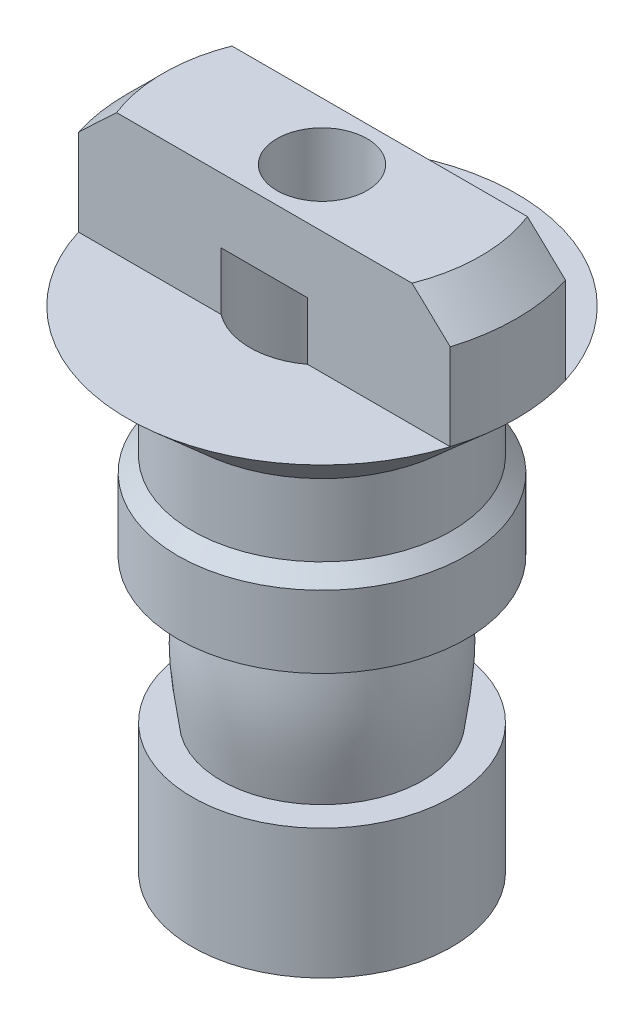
ISO-10303-21;
HEADER;
FILE_DESCRIPTION(('STEP AP214'),'2;1');
FILE_NAME('part.step','',(''),(''),'','','');
FILE_SCHEMA(('AUTOMOTIVE_DESIGN { 1 0 10303 214 1 1 1 1 }'));
ENDSEC;
DATA;
#1=APPLICATION_CONTEXT('core data for automotive mechanical design processes');
#2=APPLICATION_PROTOCOL_DEFINITION('international standard','automotive_design',2000,#1);
#3=PRODUCT_CONTEXT('',#1,'mechanical');
#4=PRODUCT('Part','Part','',(#3));
#5=PRODUCT_RELATED_PRODUCT_CATEGORY('part','',(#4));
#6=PRODUCT_DEFINITION_FORMATION('','',#4);
#7=PRODUCT_DEFINITION_CONTEXT('part definition',#1,'design');
#8=PRODUCT_DEFINITION('design','',#6,#7);
#9=PRODUCT_DEFINITION_SHAPE('','',#8);
#10=(LENGTH_UNIT() NAMED_UNIT(*) SI_UNIT(.MILLI.,.METRE.));
#11=(NAMED_UNIT(*) PLANE_ANGLE_UNIT() SI_UNIT($,.RADIAN.));
#12=(NAMED_UNIT(*) SI_UNIT($,.STERADIAN.) SOLID_ANGLE_UNIT());
#13=UNCERTAINTY_MEASURE_WITH_UNIT(LENGTH_MEASURE(1.E-05),#10,'distance_accuracy_value','');
#14=(GEOMETRIC_REPRESENTATION_CONTEXT(3) GLOBAL_UNCERTAINTY_ASSIGNED_CONTEXT((#13)) GLOBAL_UNIT_ASSIGNED_CONTEXT((#10,
#11,#12)) REPRESENTATION_CONTEXT('',''));
#15=CARTESIAN_POINT('',(0.,0.,0.));
#16=DIRECTION('',(0.,0.,1.));
#17=DIRECTION('',(1.,0.,0.));
#18=AXIS2_PLACEMENT_3D('',#15,#16,#17);
#19=CARTESIAN_POINT('',(0.,-85.,0.));
#20=DIRECTION('',(0.,1.,0.));
#21=DIRECTION('',(0.,0.,1.));
#22=AXIS2_PLACEMENT_3D('',#19,#20,#21);
#23=CYLINDRICAL_SURFACE('',#22,6.25);
#24=CARTESIAN_POINT('',(0.,0.,0.));
#25=DIRECTION('',(0.,1.,0.));
#26=DIRECTION('',(0.,0.,1.));
#27=AXIS2_PLACEMENT_3D('',#24,#25,#26);
#28=CIRCLE('',#27,6.25);
#29=CARTESIAN_POINT('',(0.,0.,6.25));
#30=VERTEX_POINT('',#29);
#31=EDGE_CURVE('E133',#30,#30,#28,.T.);
#32=ORIENTED_EDGE('',*,*,#31,.T.);
#33=EDGE_LOOP('',(#32));
#34=FACE_BOUND('',#33,.T.);
#35=CARTESIAN_POINT('',(0.,-9.00000000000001,0.));
#36=DIRECTION('',(0.,-1.,0.));
#37=DIRECTION('',(0.,0.,-1.));
#38=AXIS2_PLACEMENT_3D('',#35,#36,#37);
#39=CIRCLE('',#38,6.25);
#40=CARTESIAN_POINT('',(0.,-9.00000000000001,-6.25));
#41=VERTEX_POINT('',#40);
#42=EDGE_CURVE('E114',#41,#41,#39,.F.);
#43=ORIENTED_EDGE('',*,*,#42,.F.);
#44=EDGE_LOOP('',(#43));
#45=FACE_BOUND('',#44,.T.);
#46=ADVANCED_FACE('F27',(#34,#45),#23,.F.);
#47=CARTESIAN_POINT('',(0.,0.,0.));
#48=DIRECTION('',(0.,-1.,0.));
#49=DIRECTION('',(0.,0.,-1.));
#50=AXIS2_PLACEMENT_3D('',#47,#48,#49);
#51=CYLINDRICAL_SURFACE('',#50,27.);
#52=DIRECTION('',(0.,-1.,0.));
#53=VECTOR('',#52,1.);
#54=CARTESIAN_POINT('',(-25.7875939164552,0.,-8.));
#55=LINE('',#54,#53);
#56=CARTESIAN_POINT('',(-25.7875939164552,-17.,-8.));
#57=VERTEX_POINT('',#56);
#58=CARTESIAN_POINT('',(-25.7875939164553,-5.,-8.));
#59=VERTEX_POINT('',#58);
#60=EDGE_CURVE('E308',#57,#59,#55,.F.);
#61=ORIENTED_EDGE('',*,*,#60,.F.);
#62=CARTESIAN_POINT('',(0.,-17.,0.));
#63=DIRECTION('',(0.,-1.,0.));
#64=DIRECTION('',(0.,0.,-1.));
#65=AXIS2_PLACEMENT_3D('',#62,#63,#64);
#66=CIRCLE('',#65,27.);
#67=CARTESIAN_POINT('',(-25.7875939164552,-17.,8.));
#68=VERTEX_POINT('',#67);
#69=EDGE_CURVE('E279',#68,#57,#66,.T.);
#70=ORIENTED_EDGE('',*,*,#69,.F.);
#71=DIRECTION('',(0.,-1.,0.));
#72=VECTOR('',#71,1.);
#73=CARTESIAN_POINT('',(-25.7875939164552,0.,8.));
#74=LINE('',#73,#72);
#75=CARTESIAN_POINT('',(-25.7875939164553,-5.,8.));
#76=VERTEX_POINT('',#75);
#77=EDGE_CURVE('E184',#76,#68,#74,.T.);
#78=ORIENTED_EDGE('',*,*,#77,.F.);
#79=CARTESIAN_POINT('',(0.,-5.,0.));
#80=DIRECTION('',(0.,-1.,0.));
#81=DIRECTION('',(0.,0.,-1.));
#82=AXIS2_PLACEMENT_3D('',#79,#80,#81);
#83=CIRCLE('',#82,27.);
#84=EDGE_CURVE('E281',#76,#59,#83,.T.);
#85=ORIENTED_EDGE('',*,*,#84,.T.);
#86=EDGE_LOOP('',(#61,#70,#78,#85));
#87=FACE_BOUND('',#86,.T.);
#88=ADVANCED_FACE('F221',(#87),#51,.T.);
#89=CARTESIAN_POINT('',(0.,-5.,0.));
#90=DIRECTION('',(0.,-1.,0.));
#91=DIRECTION('',(0.,0.,-1.));
#92=AXIS2_PLACEMENT_3D('',#89,#90,#91);
#93=CONICAL_SURFACE('',#92,27.,0.785398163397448);
#94=CARTESIAN_POINT('',(-44.198798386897,-22.9169653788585,-8.));
#95=CARTESIAN_POINT('',(-43.3379944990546,-22.0699396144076,-8.));
#96=CARTESIAN_POINT('',(-42.4768122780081,-21.2232979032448,-8.));
#97=CARTESIAN_POINT('',(-40.7535067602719,-19.5309704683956,-8.));
#98=CARTESIAN_POINT('',(-39.891383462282,-18.6852847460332,-8.));
#99=CARTESIAN_POINT('',(-38.1659877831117,-16.9950340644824,-8.));
#100=CARTESIAN_POINT('',(-37.3027153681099,-16.1504691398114,-8.));
#101=CARTESIAN_POINT('',(-35.5747972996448,-14.4627458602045,-8.));
#102=CARTESIAN_POINT('',(-34.7101516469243,-13.6195875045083,-8.));
#103=CARTESIAN_POINT('',(-32.9794390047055,-11.9352878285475,-8.));
#104=CARTESIAN_POINT('',(-32.1133725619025,-11.0941459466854,-8.));
#105=CARTESIAN_POINT('',(-30.3791036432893,-9.41406734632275,-8.));
#106=CARTESIAN_POINT('',(-29.5109011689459,-8.5751306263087,-8.));
#107=CARTESIAN_POINT('',(-27.7717590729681,-6.90010089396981,-8.));
#108=CARTESIAN_POINT('',(-26.9008194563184,-6.06400787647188,-8.));
#109=CARTESIAN_POINT('',(-25.1553583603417,-4.39557024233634,-8.));
#110=CARTESIAN_POINT('',(-24.2808368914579,-3.56322561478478,-8.));
#111=CARTESIAN_POINT('',(-22.6259851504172,-1.99733239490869,-8.));
#112=CARTESIAN_POINT('',(-21.8461692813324,-1.26324049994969,-8.));
#113=CARTESIAN_POINT('',(-20.2814885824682,0.199512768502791,-8.));
#114=CARTESIAN_POINT('',(-19.496623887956,0.928174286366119,-8.));
#115=CARTESIAN_POINT('',(-18.3140198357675,2.01551861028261,-8.));
#116=CARTESIAN_POINT('',(-17.9189029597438,2.37705336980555,-8.));
#117=CARTESIAN_POINT('',(-17.1265758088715,3.09781740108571,-8.));
#118=CARTESIAN_POINT('',(-16.7293655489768,3.45704668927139,-8.));
#119=CARTESIAN_POINT('',(-15.9324088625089,4.17275249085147,-8.));
#120=CARTESIAN_POINT('',(-15.5326622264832,4.52922877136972,-8.));
#121=CARTESIAN_POINT('',(-14.7300857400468,5.2387114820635,-8.));
#122=CARTESIAN_POINT('',(-14.3272558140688,5.59171782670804,-8.));
#123=CARTESIAN_POINT('',(-13.9226040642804,5.94263708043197,-8.));
#124=B_SPLINE_CURVE_WITH_KNOTS('',3,(#94,#95,#96,#97,#98,#99,#100,#101,#102,#103,#104,#105,#106,
#107,#108,#109,#110,#111,#112,#113,#114,#115,#116,#117,#118,#119,#120,#121,#122,#123),
.UNSPECIFIED.,.F.,.F.,(4,2,2,2,2,2,2,2,2,2,2,2,2,2,4),(0.,3.62297201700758,7.2459490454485,
10.8690351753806,14.4921193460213,18.1140380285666,21.7359542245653,25.3578638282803,
28.9797628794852,32.1926941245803,35.4055396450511,37.0122130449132,38.618874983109,
40.2256713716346,41.832507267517),.UNSPECIFIED.);
#125=CARTESIAN_POINT('',(-20.4939015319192,0.,-8.));
#126=VERTEX_POINT('',#125);
#127=EDGE_CURVE('E146',#59,#126,#124,.T.);
#128=ORIENTED_EDGE('',*,*,#127,.F.);
#129=ORIENTED_EDGE('',*,*,#84,.F.);
#130=CARTESIAN_POINT('',(-13.9226040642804,5.94263708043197,8.));
#131=CARTESIAN_POINT('',(-14.3272558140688,5.59171782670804,8.));
#132=CARTESIAN_POINT('',(-14.7300857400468,5.2387114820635,8.));
#133=CARTESIAN_POINT('',(-15.5326622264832,4.52922877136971,8.));
#134=CARTESIAN_POINT('',(-15.9324088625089,4.17275249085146,8.));
#135=CARTESIAN_POINT('',(-16.7293655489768,3.45704668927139,8.));
#136=CARTESIAN_POINT('',(-17.1265758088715,3.09781740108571,8.));
#137=CARTESIAN_POINT('',(-17.9189029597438,2.37705336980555,8.));
#138=CARTESIAN_POINT('',(-18.3140198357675,2.01551861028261,8.));
#139=CARTESIAN_POINT('',(-19.496623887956,0.928174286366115,8.));
#140=CARTESIAN_POINT('',(-20.2814885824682,0.199512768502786,8.));
#141=CARTESIAN_POINT('',(-21.8461692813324,-1.26324049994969,8.));
#142=CARTESIAN_POINT('',(-22.6259851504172,-1.99733239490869,8.));
#143=CARTESIAN_POINT('',(-24.2808368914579,-3.56322561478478,8.));
#144=CARTESIAN_POINT('',(-25.1553583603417,-4.39557024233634,8.));
#145=CARTESIAN_POINT('',(-26.9008194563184,-6.06400787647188,8.));
#146=CARTESIAN_POINT('',(-27.7717590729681,-6.90010089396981,8.));
#147=CARTESIAN_POINT('',(-29.5109011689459,-8.5751306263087,8.));
#148=CARTESIAN_POINT('',(-30.3791036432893,-9.41406734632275,8.));
#149=CARTESIAN_POINT('',(-32.1133725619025,-11.0941459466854,8.));
#150=CARTESIAN_POINT('',(-32.9794390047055,-11.9352878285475,8.));
#151=CARTESIAN_POINT('',(-34.7101516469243,-13.6195875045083,8.));
#152=CARTESIAN_POINT('',(-35.5747972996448,-14.4627458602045,8.));
#153=CARTESIAN_POINT('',(-37.3027153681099,-16.1504691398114,8.));
#154=CARTESIAN_POINT('',(-38.1659877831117,-16.9950340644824,8.));
#155=CARTESIAN_POINT('',(-39.891383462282,-18.6852847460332,8.));
#156=CARTESIAN_POINT('',(-40.7535067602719,-19.5309704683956,8.));
#157=CARTESIAN_POINT('',(-42.4768122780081,-21.2232979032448,8.));
#158=CARTESIAN_POINT('',(-43.3379944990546,-22.0699396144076,8.));
#159=CARTESIAN_POINT('',(-44.198798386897,-22.9169653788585,8.));
#160=B_SPLINE_CURVE_WITH_KNOTS('',3,(#130,#131,#132,#133,#134,#135,#136,#137,#138,#139,#140,
#141,#142,#143,#144,#145,#146,#147,#148,#149,#150,#151,#152,#153,#154,#155,#156,#157,#158,#159),
.UNSPECIFIED.,.F.,.F.,(4,2,2,2,2,2,2,2,2,2,2,2,2,2,4),(0.,1.60683589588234,3.21363228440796,
4.8202942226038,6.42696762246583,9.63981314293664,12.8527443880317,16.4746434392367,
20.0965530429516,23.7184692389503,27.3403879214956,30.9634720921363,34.5865582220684,
38.2095352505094,41.8325072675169),.UNSPECIFIED.);
#161=CARTESIAN_POINT('',(-20.4939015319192,0.,8.));
#162=VERTEX_POINT('',#161);
#163=EDGE_CURVE('E179',#162,#76,#160,.T.);
#164=ORIENTED_EDGE('',*,*,#163,.F.);
#165=CARTESIAN_POINT('',(0.,0.,0.));
#166=DIRECTION('',(0.,-1.,0.));
#167=DIRECTION('',(0.,0.,-1.));
#168=AXIS2_PLACEMENT_3D('',#165,#166,#167);
#169=CIRCLE('',#168,22.);
#170=EDGE_CURVE('E194',#162,#126,#169,.T.);
#171=ORIENTED_EDGE('',*,*,#170,.T.);
#172=EDGE_LOOP('',(#128,#129,#164,#171));
#173=FACE_BOUND('',#172,.T.);
#174=ADVANCED_FACE('F216',(#173),#93,.T.);
#175=CARTESIAN_POINT('',(0.,-85.,0.));
#176=DIRECTION('',(0.,-1.,0.));
#177=DIRECTION('',(0.,0.,-1.));
#178=AXIS2_PLACEMENT_3D('',#175,#176,#177);
#179=PLANE('',#178);
#180=CARTESIAN_POINT('',(0.,-85.,0.));
#181=DIRECTION('',(0.,-1.,0.));
#182=DIRECTION('',(0.,0.,-1.));
#183=AXIS2_PLACEMENT_3D('',#180,#181,#182);
#184=CIRCLE('',#183,13.);
#185=CARTESIAN_POINT('',(0.,-85.,-13.));
#186=VERTEX_POINT('',#185);
#187=EDGE_CURVE('E11',#186,#186,#184,.F.);
#188=ORIENTED_EDGE('',*,*,#187,.T.);
#189=EDGE_LOOP('',(#188));
#190=FACE_BOUND('',#189,.T.);
#191=CARTESIAN_POINT('',(0.,-85.,0.));
#192=DIRECTION('',(0.,-1.,0.));
#193=DIRECTION('',(0.,0.,-1.));
#194=AXIS2_PLACEMENT_3D('',#191,#192,#193);
#195=CIRCLE('',#194,18.);
#196=CARTESIAN_POINT('',(0.,-85.,-18.));
#197=VERTEX_POINT('',#196);
#198=EDGE_CURVE('E254',#197,#197,#195,.T.);
#199=ORIENTED_EDGE('',*,*,#198,.T.);
#200=EDGE_LOOP('',(#199));
#201=FACE_BOUND('',#200,.T.);
#202=ADVANCED_FACE('F29',(#190,#201),#179,.T.);
#203=CARTESIAN_POINT('',(0.,0.,0.));
#204=DIRECTION('',(0.,-1.,0.));
#205=DIRECTION('',(0.,0.,-1.));
#206=AXIS2_PLACEMENT_3D('',#203,#204,#205);
#207=CYLINDRICAL_SURFACE('',#206,18.);
#208=CARTESIAN_POINT('',(0.,-67.,0.));
#209=DIRECTION('',(0.,-1.,0.));
#210=DIRECTION('',(0.,0.,-1.));
#211=AXIS2_PLACEMENT_3D('',#208,#209,#210);
#212=CIRCLE('',#211,18.);
#213=CARTESIAN_POINT('',(0.,-67.,-18.));
#214=VERTEX_POINT('',#213);
#215=EDGE_CURVE('E257',#214,#214,#212,.T.);
#216=ORIENTED_EDGE('',*,*,#215,.T.);
#217=EDGE_LOOP('',(#216));
#218=FACE_BOUND('',#217,.T.);
#219=ORIENTED_EDGE('',*,*,#198,.F.);
#220=EDGE_LOOP('',(#219));
#221=FACE_BOUND('',#220,.T.);
#222=ADVANCED_FACE('F209',(#218,#221),#207,.T.);
#223=CARTESIAN_POINT('',(14.,-67.,0.));
#224=DIRECTION('',(0.,1.,0.));
#225=DIRECTION('',(0.,0.,1.));
#226=AXIS2_PLACEMENT_3D('',#223,#224,#225);
#227=PLANE('',#226);
#228=CARTESIAN_POINT('',(0.,-67.,0.));
#229=DIRECTION('',(0.,-1.,0.));
#230=DIRECTION('',(0.,0.,-1.));
#231=AXIS2_PLACEMENT_3D('',#228,#229,#230);
#232=CIRCLE('',#231,14.);
#233=CARTESIAN_POINT('',(0.,-67.,-14.));
#234=VERTEX_POINT('',#233);
#235=EDGE_CURVE('E259',#234,#234,#232,.T.);
#236=ORIENTED_EDGE('',*,*,#235,.T.);
#237=EDGE_LOOP('',(#236));
#238=FACE_BOUND('',#237,.T.);
#239=ORIENTED_EDGE('',*,*,#215,.F.);
#240=EDGE_LOOP('',(#239));
#241=FACE_BOUND('',#240,.T.);
#242=ADVANCED_FACE('F205',(#238,#241),#227,.T.);
#243=CARTESIAN_POINT('',(14.,-67.,0.));
#244=CARTESIAN_POINT('',(14.4927243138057,-63.7421470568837,0.));
#245=CARTESIAN_POINT('',(15.5006642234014,-57.0777306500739,0.));
#246=CARTESIAN_POINT('',(14.507607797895,-50.4088469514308,0.));
#247=CARTESIAN_POINT('',(14.,-47.,0.));
#248=B_SPLINE_CURVE_WITH_KNOTS('',3,(#243,#244,#245,#246,#247),.UNSPECIFIED.,.F.,.F.,(4,1,4),
(0.,0.488842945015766,1.),.UNSPECIFIED.);
#249=CARTESIAN_POINT('',(0.,0.,0.));
#250=DIRECTION('',(0.,-1.,0.));
#251=AXIS1_PLACEMENT('',#249,#250);
#252=SURFACE_OF_REVOLUTION('',#248,#251);
#253=CARTESIAN_POINT('',(0.,-47.,0.));
#254=DIRECTION('',(0.,-1.,0.));
#255=DIRECTION('',(0.,0.,-1.));
#256=AXIS2_PLACEMENT_3D('',#253,#254,#255);
#257=CIRCLE('',#256,14.);
#258=CARTESIAN_POINT('',(0.,-47.,-14.));
#259=VERTEX_POINT('',#258);
#260=EDGE_CURVE('E262',#259,#259,#257,.T.);
#261=ORIENTED_EDGE('',*,*,#260,.T.);
#262=EDGE_LOOP('',(#261));
#263=FACE_BOUND('',#262,.T.);
#264=ORIENTED_EDGE('',*,*,#235,.F.);
#265=EDGE_LOOP('',(#264));
#266=FACE_BOUND('',#265,.T.);
#267=ADVANCED_FACE('F200',(#263,#266),#252,.F.);
#268=CARTESIAN_POINT('',(20.,-47.,0.));
#269=DIRECTION('',(0.,-1.,0.));
#270=DIRECTION('',(0.,0.,-1.));
#271=AXIS2_PLACEMENT_3D('',#268,#269,#270);
#272=PLANE('',#271);
#273=CARTESIAN_POINT('',(0.,-47.,0.));
#274=DIRECTION('',(0.,-1.,0.));
#275=DIRECTION('',(0.,0.,-1.));
#276=AXIS2_PLACEMENT_3D('',#273,#274,#275);
#277=CIRCLE('',#276,20.);
#278=CARTESIAN_POINT('',(0.,-47.,-20.));
#279=VERTEX_POINT('',#278);
#280=EDGE_CURVE('E265',#279,#279,#277,.T.);
#281=ORIENTED_EDGE('',*,*,#280,.T.);
#282=EDGE_LOOP('',(#281));
#283=FACE_BOUND('',#282,.T.);
#284=ORIENTED_EDGE('',*,*,#260,.F.);
#285=EDGE_LOOP('',(#284));
#286=FACE_BOUND('',#285,.T.);
#287=ADVANCED_FACE('F204',(#283,#286),#272,.T.);
#288=CARTESIAN_POINT('',(0.,0.,0.));
#289=DIRECTION('',(0.,-1.,0.));
#290=DIRECTION('',(0.,0.,-1.));
#291=AXIS2_PLACEMENT_3D('',#288,#289,#290);
#292=CYLINDRICAL_SURFACE('',#291,20.);
#293=CARTESIAN_POINT('',(0.,-37.,0.));
#294=DIRECTION('',(0.,-1.,0.));
#295=DIRECTION('',(0.,0.,-1.));
#296=AXIS2_PLACEMENT_3D('',#293,#294,#295);
#297=CIRCLE('',#296,20.);
#298=CARTESIAN_POINT('',(0.,-37.,-20.));
#299=VERTEX_POINT('',#298);
#300=EDGE_CURVE('E268',#299,#299,#297,.T.);
#301=ORIENTED_EDGE('',*,*,#300,.T.);
#302=EDGE_LOOP('',(#301));
#303=FACE_BOUND('',#302,.T.);
#304=ORIENTED_EDGE('',*,*,#280,.F.);
#305=EDGE_LOOP('',(#304));
#306=FACE_BOUND('',#305,.T.);
#307=ADVANCED_FACE('F336',(#303,#306),#292,.T.);
#308=CARTESIAN_POINT('',(0.,-37.,0.));
#309=DIRECTION('',(0.,-1.,0.));
#310=DIRECTION('',(0.,0.,-1.));
#311=AXIS2_PLACEMENT_3D('',#308,#309,#310);
#312=CONICAL_SURFACE('',#311,20.,0.785398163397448);
#313=CARTESIAN_POINT('',(0.,-35.,0.));
#314=DIRECTION('',(0.,-1.,0.));
#315=DIRECTION('',(0.,0.,-1.));
#316=AXIS2_PLACEMENT_3D('',#313,#314,#315);
#317=CIRCLE('',#316,18.);
#318=CARTESIAN_POINT('',(0.,-35.,-18.));
#319=VERTEX_POINT('',#318);
#320=EDGE_CURVE('E271',#319,#319,#317,.T.);
#321=ORIENTED_EDGE('',*,*,#320,.T.);
#322=EDGE_LOOP('',(#321));
#323=FACE_BOUND('',#322,.T.);
#324=ORIENTED_EDGE('',*,*,#300,.F.);
#325=EDGE_LOOP('',(#324));
#326=FACE_BOUND('',#325,.T.);
#327=ADVANCED_FACE('F333',(#323,#326),#312,.T.);
#328=CARTESIAN_POINT('',(0.,0.,0.));
#329=DIRECTION('',(0.,-1.,0.));
#330=DIRECTION('',(0.,0.,-1.));
#331=AXIS2_PLACEMENT_3D('',#328,#329,#330);
#332=CYLINDRICAL_SURFACE('',#331,18.);
#333=CARTESIAN_POINT('',(0.,-25.,0.));
#334=DIRECTION('',(0.,-1.,0.));
#335=DIRECTION('',(0.,0.,-1.));
#336=AXIS2_PLACEMENT_3D('',#333,#334,#335);
#337=CIRCLE('',#336,18.);
#338=CARTESIAN_POINT('',(0.,-25.,-18.));
#339=VERTEX_POINT('',#338);
#340=EDGE_CURVE('E274',#339,#339,#337,.T.);
#341=ORIENTED_EDGE('',*,*,#340,.T.);
#342=EDGE_LOOP('',(#341));
#343=FACE_BOUND('',#342,.T.);
#344=ORIENTED_EDGE('',*,*,#320,.F.);
#345=EDGE_LOOP('',(#344));
#346=FACE_BOUND('',#345,.T.);
#347=ADVANCED_FACE('F328',(#343,#346),#332,.T.);
#348=CARTESIAN_POINT('',(0.,-25.,0.));
#349=DIRECTION('',(0.,1.,0.));
#350=DIRECTION('',(0.,0.,1.));
#351=AXIS2_PLACEMENT_3D('',#348,#349,#350);
#352=CONICAL_SURFACE('',#351,18.,0.844153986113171);
#353=CARTESIAN_POINT('',(25.7875939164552,-17.,8.));
#354=VERTEX_POINT('',#353);
#355=EDGE_CURVE('E277',#354,#68,#66,.T.);
#356=ORIENTED_EDGE('',*,*,#355,.T.);
#357=ORIENTED_EDGE('',*,*,#69,.T.);
#358=CARTESIAN_POINT('',(25.7875939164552,-17.,-8.));
#359=VERTEX_POINT('',#358);
#360=EDGE_CURVE('E288',#57,#359,#66,.T.);
#361=ORIENTED_EDGE('',*,*,#360,.T.);
#362=EDGE_CURVE('E280',#359,#354,#66,.T.);
#363=ORIENTED_EDGE('',*,*,#362,.T.);
#364=EDGE_LOOP('',(#356,#357,#361,#363));
#365=FACE_BOUND('',#364,.T.);
#366=ORIENTED_EDGE('',*,*,#340,.F.);
#367=EDGE_LOOP('',(#366));
#368=FACE_BOUND('',#367,.T.);
#369=ADVANCED_FACE('F319',(#365,#368),#352,.T.);
#370=DIRECTION('',(0.,-1.,0.));
#371=VECTOR('',#370,1.);
#372=CARTESIAN_POINT('',(25.7875939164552,0.,-8.));
#373=LINE('',#372,#371);
#374=CARTESIAN_POINT('',(25.7875939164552,-5.,-8.));
#375=VERTEX_POINT('',#374);
#376=EDGE_CURVE('E309',#375,#359,#373,.T.);
#377=ORIENTED_EDGE('',*,*,#376,.F.);
#378=CARTESIAN_POINT('',(25.7875939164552,-5.,8.));
#379=VERTEX_POINT('',#378);
#380=EDGE_CURVE('E283',#375,#379,#83,.T.);
#381=ORIENTED_EDGE('',*,*,#380,.T.);
#382=DIRECTION('',(0.,-1.,0.));
#383=VECTOR('',#382,1.);
#384=CARTESIAN_POINT('',(25.7875939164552,0.,8.));
#385=LINE('',#384,#383);
#386=EDGE_CURVE('E186',#354,#379,#385,.F.);
#387=ORIENTED_EDGE('',*,*,#386,.F.);
#388=ORIENTED_EDGE('',*,*,#362,.F.);
#389=EDGE_LOOP('',(#377,#381,#387,#388));
#390=FACE_BOUND('',#389,.T.);
#391=ADVANCED_FACE('F227',(#390),#51,.T.);
#392=CARTESIAN_POINT('',(13.9226040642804,5.94263708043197,-8.));
#393=CARTESIAN_POINT('',(14.3272558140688,5.59171782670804,-8.));
#394=CARTESIAN_POINT('',(14.7300857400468,5.2387114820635,-8.));
#395=CARTESIAN_POINT('',(15.5326622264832,4.52922877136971,-8.));
#396=CARTESIAN_POINT('',(15.9324088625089,4.17275249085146,-8.));
#397=CARTESIAN_POINT('',(16.7293655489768,3.45704668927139,-8.));
#398=CARTESIAN_POINT('',(17.1265758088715,3.0978174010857,-8.));
#399=CARTESIAN_POINT('',(17.9189029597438,2.37705336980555,-8.));
#400=CARTESIAN_POINT('',(18.3140198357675,2.01551861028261,-8.));
#401=CARTESIAN_POINT('',(19.496623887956,0.928174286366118,-8.));
#402=CARTESIAN_POINT('',(20.2814885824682,0.199512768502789,-8.));
#403=CARTESIAN_POINT('',(21.8461692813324,-1.26324049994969,-8.));
#404=CARTESIAN_POINT('',(22.6259851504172,-1.99733239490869,-8.));
#405=CARTESIAN_POINT('',(24.2808368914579,-3.56322561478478,-8.));
#406=CARTESIAN_POINT('',(25.1553583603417,-4.39557024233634,-8.));
#407=CARTESIAN_POINT('',(26.9008194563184,-6.06400787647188,-8.));
#408=CARTESIAN_POINT('',(27.7717590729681,-6.90010089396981,-8.));
#409=CARTESIAN_POINT('',(29.5109011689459,-8.5751306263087,-8.));
#410=CARTESIAN_POINT('',(30.3791036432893,-9.41406734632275,-8.));
#411=CARTESIAN_POINT('',(32.1133725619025,-11.0941459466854,-8.));
#412=CARTESIAN_POINT('',(32.9794390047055,-11.9352878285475,-8.));
#413=CARTESIAN_POINT('',(34.7101516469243,-13.6195875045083,-8.));
#414=CARTESIAN_POINT('',(35.5747972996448,-14.4627458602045,-8.));
#415=CARTESIAN_POINT('',(37.3027153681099,-16.1504691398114,-8.));
#416=CARTESIAN_POINT('',(38.1659877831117,-16.9950340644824,-8.));
#417=CARTESIAN_POINT('',(39.891383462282,-18.6852847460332,-8.));
#418=CARTESIAN_POINT('',(40.7535067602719,-19.5309704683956,-8.));
#419=CARTESIAN_POINT('',(42.4768122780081,-21.2232979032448,-8.));
#420=CARTESIAN_POINT('',(43.3379944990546,-22.0699396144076,-8.));
#421=CARTESIAN_POINT('',(44.198798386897,-22.9169653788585,-8.));
#422=B_SPLINE_CURVE_WITH_KNOTS('',3,(#392,#393,#394,#395,#396,#397,#398,#399,#400,#401,#402,
#403,#404,#405,#406,#407,#408,#409,#410,#411,#412,#413,#414,#415,#416,#417,#418,#419,#420,#421),
.UNSPECIFIED.,.F.,.F.,(4,2,2,2,2,2,2,2,2,2,2,2,2,2,4),(0.,1.60683589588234,3.21363228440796,
4.8202942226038,6.42696762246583,9.63981314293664,12.8527443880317,16.4746434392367,
20.0965530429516,23.7184692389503,27.3403879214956,30.9634720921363,34.5865582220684,
38.2095352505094,41.8325072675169),.UNSPECIFIED.);
#423=CARTESIAN_POINT('',(20.4939015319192,0.,-8.));
#424=VERTEX_POINT('',#423);
#425=EDGE_CURVE('E139',#424,#375,#422,.T.);
#426=ORIENTED_EDGE('',*,*,#425,.F.);
#427=CARTESIAN_POINT('',(20.4939015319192,0.,8.));
#428=VERTEX_POINT('',#427);
#429=EDGE_CURVE('E189',#424,#428,#169,.T.);
#430=ORIENTED_EDGE('',*,*,#429,.T.);
#431=CARTESIAN_POINT('',(44.198798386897,-22.9169653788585,8.));
#432=CARTESIAN_POINT('',(43.3379944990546,-22.0699396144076,8.));
#433=CARTESIAN_POINT('',(42.4768122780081,-21.2232979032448,8.));
#434=CARTESIAN_POINT('',(40.7535067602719,-19.5309704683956,8.));
#435=CARTESIAN_POINT('',(39.891383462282,-18.6852847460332,8.));
#436=CARTESIAN_POINT('',(38.1659877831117,-16.9950340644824,8.));
#437=CARTESIAN_POINT('',(37.3027153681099,-16.1504691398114,8.));
#438=CARTESIAN_POINT('',(35.5747972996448,-14.4627458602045,8.));
#439=CARTESIAN_POINT('',(34.7101516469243,-13.6195875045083,8.));
#440=CARTESIAN_POINT('',(32.9794390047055,-11.9352878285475,8.));
#441=CARTESIAN_POINT('',(32.1133725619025,-11.0941459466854,8.));
#442=CARTESIAN_POINT('',(30.3791036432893,-9.41406734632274,8.));
#443=CARTESIAN_POINT('',(29.5109011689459,-8.5751306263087,8.));
#444=CARTESIAN_POINT('',(27.7717590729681,-6.9001008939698,8.));
#445=CARTESIAN_POINT('',(26.9008194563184,-6.06400787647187,8.));
#446=CARTESIAN_POINT('',(25.1553583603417,-4.39557024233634,8.));
#447=CARTESIAN_POINT('',(24.2808368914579,-3.56322561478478,8.));
#448=CARTESIAN_POINT('',(22.6259851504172,-1.99733239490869,8.));
#449=CARTESIAN_POINT('',(21.8461692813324,-1.2632404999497,8.));
#450=CARTESIAN_POINT('',(20.2814885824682,0.199512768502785,8.));
#451=CARTESIAN_POINT('',(19.496623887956,0.928174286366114,8.));
#452=CARTESIAN_POINT('',(18.3140198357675,2.01551861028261,8.));
#453=CARTESIAN_POINT('',(17.9189029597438,2.37705336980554,8.));
#454=CARTESIAN_POINT('',(17.1265758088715,3.0978174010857,8.));
#455=CARTESIAN_POINT('',(16.7293655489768,3.45704668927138,8.));
#456=CARTESIAN_POINT('',(15.9324088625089,4.17275249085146,8.));
#457=CARTESIAN_POINT('',(15.5326622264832,4.52922877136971,8.));
#458=CARTESIAN_POINT('',(14.7300857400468,5.2387114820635,8.));
#459=CARTESIAN_POINT('',(14.3272558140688,5.59171782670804,8.));
#460=CARTESIAN_POINT('',(13.9226040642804,5.94263708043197,8.));
#461=B_SPLINE_CURVE_WITH_KNOTS('',3,(#431,#432,#433,#434,#435,#436,#437,#438,#439,#440,#441,
#442,#443,#444,#445,#446,#447,#448,#449,#450,#451,#452,#453,#454,#455,#456,#457,#458,#459,#460),
.UNSPECIFIED.,.F.,.F.,(4,2,2,2,2,2,2,2,2,2,2,2,2,2,4),(0.,3.62297201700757,7.2459490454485,
10.8690351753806,14.4921193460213,18.1140380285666,21.7359542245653,25.3578638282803,
28.9797628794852,32.1926941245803,35.4055396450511,37.0122130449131,38.618874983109,
40.2256713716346,41.8325072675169),.UNSPECIFIED.);
#462=EDGE_CURVE('E173',#379,#428,#461,.T.);
#463=ORIENTED_EDGE('',*,*,#462,.F.);
#464=ORIENTED_EDGE('',*,*,#380,.F.);
#465=EDGE_LOOP('',(#426,#430,#463,#464));
#466=FACE_BOUND('',#465,.T.);
#467=ADVANCED_FACE('F151',(#466),#93,.T.);
#468=CARTESIAN_POINT('',(0.,0.,0.));
#469=DIRECTION('',(0.,1.,0.));
#470=DIRECTION('',(0.,0.,1.));
#471=AXIS2_PLACEMENT_3D('',#468,#469,#470);
#472=PLANE('',#471);
#473=ORIENTED_EDGE('',*,*,#31,.F.);
#474=EDGE_LOOP('',(#473));
#475=FACE_BOUND('',#474,.T.);
#476=DIRECTION('',(1.,0.,0.));
#477=VECTOR('',#476,1.);
#478=CARTESIAN_POINT('',(0.,0.,-8.));
#479=LINE('',#478,#477);
#480=EDGE_CURVE('E246',#126,#424,#479,.T.);
#481=ORIENTED_EDGE('',*,*,#480,.F.);
#482=ORIENTED_EDGE('',*,*,#170,.F.);
#483=DIRECTION('',(-1.,0.,0.));
#484=VECTOR('',#483,1.);
#485=CARTESIAN_POINT('',(0.,0.,8.));
#486=LINE('',#485,#484);
#487=EDGE_CURVE('E252',#428,#162,#486,.T.);
#488=ORIENTED_EDGE('',*,*,#487,.F.);
#489=ORIENTED_EDGE('',*,*,#429,.F.);
#490=EDGE_LOOP('',(#481,#482,#488,#489));
#491=FACE_BOUND('',#490,.T.);
#492=ADVANCED_FACE('F169',(#475,#491),#472,.T.);
#493=CARTESIAN_POINT('',(-40.,-17.,8.));
#494=DIRECTION('',(0.,0.,-1.));
#495=DIRECTION('',(-1.,0.,0.));
#496=AXIS2_PLACEMENT_3D('',#493,#494,#495);
#497=PLANE('',#496);
#498=DIRECTION('',(-1.,0.,0.));
#499=VECTOR('',#498,1.);
#500=CARTESIAN_POINT('',(-40.,-9.00000000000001,8.));
#501=LINE('',#500,#499);
#502=CARTESIAN_POINT('',(6.00000000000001,-9.00000000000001,8.));
#503=VERTEX_POINT('',#502);
#504=CARTESIAN_POINT('',(-6.00000000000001,-9.00000000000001,8.));
#505=VERTEX_POINT('',#504);
#506=EDGE_CURVE('E113',#503,#505,#501,.T.);
#507=ORIENTED_EDGE('',*,*,#506,.F.);
#508=DIRECTION('',(0.,-1.,0.));
#509=VECTOR('',#508,1.);
#510=CARTESIAN_POINT('',(6.00000000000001,-9.00000000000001,8.));
#511=LINE('',#510,#509);
#512=CARTESIAN_POINT('',(6.00000000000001,-17.,8.));
#513=VERTEX_POINT('',#512);
#514=EDGE_CURVE('E118',#503,#513,#511,.T.);
#515=ORIENTED_EDGE('',*,*,#514,.T.);
#516=DIRECTION('',(1.,0.,0.));
#517=VECTOR('',#516,1.);
#518=CARTESIAN_POINT('',(-40.,-17.,8.));
#519=LINE('',#518,#517);
#520=EDGE_CURVE('E311',#513,#354,#519,.T.);
#521=ORIENTED_EDGE('',*,*,#520,.T.);
#522=ORIENTED_EDGE('',*,*,#386,.T.);
#523=ORIENTED_EDGE('',*,*,#462,.T.);
#524=ORIENTED_EDGE('',*,*,#487,.T.);
#525=ORIENTED_EDGE('',*,*,#163,.T.);
#526=ORIENTED_EDGE('',*,*,#77,.T.);
#527=CARTESIAN_POINT('',(-6.00000000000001,-17.,8.));
#528=VERTEX_POINT('',#527);
#529=EDGE_CURVE('E306',#68,#528,#519,.T.);
#530=ORIENTED_EDGE('',*,*,#529,.T.);
#531=DIRECTION('',(0.,-1.,0.));
#532=VECTOR('',#531,1.);
#533=CARTESIAN_POINT('',(-6.00000000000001,-9.00000000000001,8.));
#534=LINE('',#533,#532);
#535=EDGE_CURVE('E42',#528,#505,#534,.F.);
#536=ORIENTED_EDGE('',*,*,#535,.T.);
#537=EDGE_LOOP('',(#507,#515,#521,#522,#523,#524,#525,#526,#530,#536));
#538=FACE_BOUND('',#537,.T.);
#539=ADVANCED_FACE('F165',(#538),#497,.F.);
#540=CARTESIAN_POINT('',(-40.,-17.,8.));
#541=DIRECTION('',(0.,-1.,0.));
#542=DIRECTION('',(0.,0.,-1.));
#543=AXIS2_PLACEMENT_3D('',#540,#541,#542);
#544=PLANE('',#543);
#545=ORIENTED_EDGE('',*,*,#520,.F.);
#546=CARTESIAN_POINT('',(0.,-17.,0.));
#547=DIRECTION('',(0.,-1.,0.));
#548=DIRECTION('',(0.,0.,-1.));
#549=AXIS2_PLACEMENT_3D('',#546,#547,#548);
#550=CIRCLE('',#549,10.);
#551=EDGE_CURVE('E126',#513,#528,#550,.T.);
#552=ORIENTED_EDGE('',*,*,#551,.T.);
#553=ORIENTED_EDGE('',*,*,#529,.F.);
#554=ORIENTED_EDGE('',*,*,#355,.F.);
#555=EDGE_LOOP('',(#545,#552,#553,#554));
#556=FACE_BOUND('',#555,.T.);
#557=ADVANCED_FACE('F160',(#556),#544,.F.);
#558=CARTESIAN_POINT('',(-40.,-17.,-8.));
#559=DIRECTION('',(0.,0.,1.));
#560=DIRECTION('',(1.,0.,0.));
#561=AXIS2_PLACEMENT_3D('',#558,#559,#560);
#562=PLANE('',#561);
#563=DIRECTION('',(1.,0.,0.));
#564=VECTOR('',#563,1.);
#565=CARTESIAN_POINT('',(-40.,-9.00000000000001,-8.));
#566=LINE('',#565,#564);
#567=CARTESIAN_POINT('',(-6.00000000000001,-9.00000000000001,-8.));
#568=VERTEX_POINT('',#567);
#569=CARTESIAN_POINT('',(6.00000000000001,-9.00000000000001,-8.));
#570=VERTEX_POINT('',#569);
#571=EDGE_CURVE('E106',#568,#570,#566,.T.);
#572=ORIENTED_EDGE('',*,*,#571,.F.);
#573=DIRECTION('',(0.,-1.,0.));
#574=VECTOR('',#573,1.);
#575=CARTESIAN_POINT('',(-6.00000000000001,-9.00000000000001,-8.));
#576=LINE('',#575,#574);
#577=CARTESIAN_POINT('',(-6.00000000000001,-17.,-8.));
#578=VERTEX_POINT('',#577);
#579=EDGE_CURVE('E124',#568,#578,#576,.T.);
#580=ORIENTED_EDGE('',*,*,#579,.T.);
#581=DIRECTION('',(1.,0.,0.));
#582=VECTOR('',#581,1.);
#583=CARTESIAN_POINT('',(-40.,-17.,-8.));
#584=LINE('',#583,#582);
#585=EDGE_CURVE('E136',#57,#578,#584,.T.);
#586=ORIENTED_EDGE('',*,*,#585,.F.);
#587=ORIENTED_EDGE('',*,*,#60,.T.);
#588=ORIENTED_EDGE('',*,*,#127,.T.);
#589=ORIENTED_EDGE('',*,*,#480,.T.);
#590=ORIENTED_EDGE('',*,*,#425,.T.);
#591=ORIENTED_EDGE('',*,*,#376,.T.);
#592=CARTESIAN_POINT('',(6.00000000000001,-17.,-8.));
#593=VERTEX_POINT('',#592);
#594=EDGE_CURVE('E123',#593,#359,#584,.T.);
#595=ORIENTED_EDGE('',*,*,#594,.F.);
#596=DIRECTION('',(0.,-1.,0.));
#597=VECTOR('',#596,1.);
#598=CARTESIAN_POINT('',(6.00000000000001,-9.00000000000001,-8.));
#599=LINE('',#598,#597);
#600=EDGE_CURVE('E49',#593,#570,#599,.F.);
#601=ORIENTED_EDGE('',*,*,#600,.T.);
#602=EDGE_LOOP('',(#572,#580,#586,#587,#588,#589,#590,#591,#595,#601));
#603=FACE_BOUND('',#602,.T.);
#604=ADVANCED_FACE('F121',(#603),#562,.F.);
#605=CARTESIAN_POINT('',(-40.,-17.,-8.));
#606=DIRECTION('',(0.,-1.,0.));
#607=DIRECTION('',(0.,0.,-1.));
#608=AXIS2_PLACEMENT_3D('',#605,#606,#607);
#609=PLANE('',#608);
#610=ORIENTED_EDGE('',*,*,#585,.T.);
#611=CARTESIAN_POINT('',(0.,-17.,0.));
#612=DIRECTION('',(0.,-1.,0.));
#613=DIRECTION('',(0.,0.,-1.));
#614=AXIS2_PLACEMENT_3D('',#611,#612,#613);
#615=CIRCLE('',#614,10.);
#616=EDGE_CURVE('E245',#578,#593,#615,.T.);
#617=ORIENTED_EDGE('',*,*,#616,.T.);
#618=ORIENTED_EDGE('',*,*,#594,.T.);
#619=ORIENTED_EDGE('',*,*,#360,.F.);
#620=EDGE_LOOP('',(#610,#617,#618,#619));
#621=FACE_BOUND('',#620,.T.);
#622=ADVANCED_FACE('F159',(#621),#609,.F.);
#623=CARTESIAN_POINT('',(0.,-9.00000000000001,0.));
#624=DIRECTION('',(0.,-1.,0.));
#625=DIRECTION('',(0.,0.,-1.));
#626=AXIS2_PLACEMENT_3D('',#623,#624,#625);
#627=CYLINDRICAL_SURFACE('',#626,10.);
#628=CARTESIAN_POINT('',(0.,-81.,0.));
#629=DIRECTION('',(0.,-1.,0.));
#630=DIRECTION('',(0.,0.,-1.));
#631=AXIS2_PLACEMENT_3D('',#628,#629,#630);
#632=CIRCLE('',#631,10.);
#633=CARTESIAN_POINT('',(0.,-81.,-10.));
#634=VERTEX_POINT('',#633);
#635=EDGE_CURVE('E35',#634,#634,#632,.T.);
#636=ORIENTED_EDGE('',*,*,#635,.T.);
#637=EDGE_LOOP('',(#636));
#638=FACE_BOUND('',#637,.T.);
#639=CARTESIAN_POINT('',(0.,-9.00000000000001,0.));
#640=DIRECTION('',(0.,-1.,0.));
#641=DIRECTION('',(0.,0.,-1.));
#642=AXIS2_PLACEMENT_3D('',#639,#640,#641);
#643=CIRCLE('',#642,10.);
#644=EDGE_CURVE('E108',#570,#503,#643,.T.);
#645=ORIENTED_EDGE('',*,*,#644,.F.);
#646=ORIENTED_EDGE('',*,*,#600,.F.);
#647=ORIENTED_EDGE('',*,*,#616,.F.);
#648=ORIENTED_EDGE('',*,*,#579,.F.);
#649=EDGE_CURVE('E110',#505,#568,#643,.T.);
#650=ORIENTED_EDGE('',*,*,#649,.F.);
#651=ORIENTED_EDGE('',*,*,#535,.F.);
#652=ORIENTED_EDGE('',*,*,#551,.F.);
#653=ORIENTED_EDGE('',*,*,#514,.F.);
#654=EDGE_LOOP('',(#645,#646,#647,#648,#650,#651,#652,#653));
#655=FACE_BOUND('',#654,.T.);
#656=ADVANCED_FACE('F116',(#638,#655),#627,.F.);
#657=CARTESIAN_POINT('',(0.,-9.00000000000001,0.));
#658=DIRECTION('',(0.,-1.,0.));
#659=DIRECTION('',(0.,0.,-1.));
#660=AXIS2_PLACEMENT_3D('',#657,#658,#659);
#661=PLANE('',#660);
#662=ORIENTED_EDGE('',*,*,#42,.T.);
#663=EDGE_LOOP('',(#662));
#664=FACE_BOUND('',#663,.T.);
#665=ORIENTED_EDGE('',*,*,#506,.T.);
#666=ORIENTED_EDGE('',*,*,#649,.T.);
#667=ORIENTED_EDGE('',*,*,#571,.T.);
#668=ORIENTED_EDGE('',*,*,#644,.T.);
#669=EDGE_LOOP('',(#665,#666,#667,#668));
#670=FACE_BOUND('',#669,.T.);
#671=ADVANCED_FACE('F107',(#664,#670),#661,.T.);
#672=CARTESIAN_POINT('',(0.,-81.,0.));
#673=DIRECTION('',(0.,-1.,0.));
#674=DIRECTION('',(0.,0.,-1.));
#675=AXIS2_PLACEMENT_3D('',#672,#673,#674);
#676=CONICAL_SURFACE('',#675,10.,0.643501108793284);
#677=ORIENTED_EDGE('',*,*,#187,.F.);
#678=EDGE_LOOP('',(#677));
#679=FACE_BOUND('',#678,.T.);
#680=ORIENTED_EDGE('',*,*,#635,.F.);
#681=EDGE_LOOP('',(#680));
#682=FACE_BOUND('',#681,.T.);
#683=ADVANCED_FACE('F235',(#679,#682),#676,.F.);
#684=CLOSED_SHELL('',(#46,#88,#174,#202,#222,#242,#267,#287,#307,#327,#347,#369,#391,#467,#492,
#539,#557,#604,#622,#656,#671,#683));
#685=MANIFOLD_SOLID_BREP('B2',#684);
#686=ADVANCED_BREP_SHAPE_REPRESENTATION('',(#18,#685),#14);
#687=SHAPE_DEFINITION_REPRESENTATION(#9,#686);
ENDSEC;
END-ISO-10303-21;
